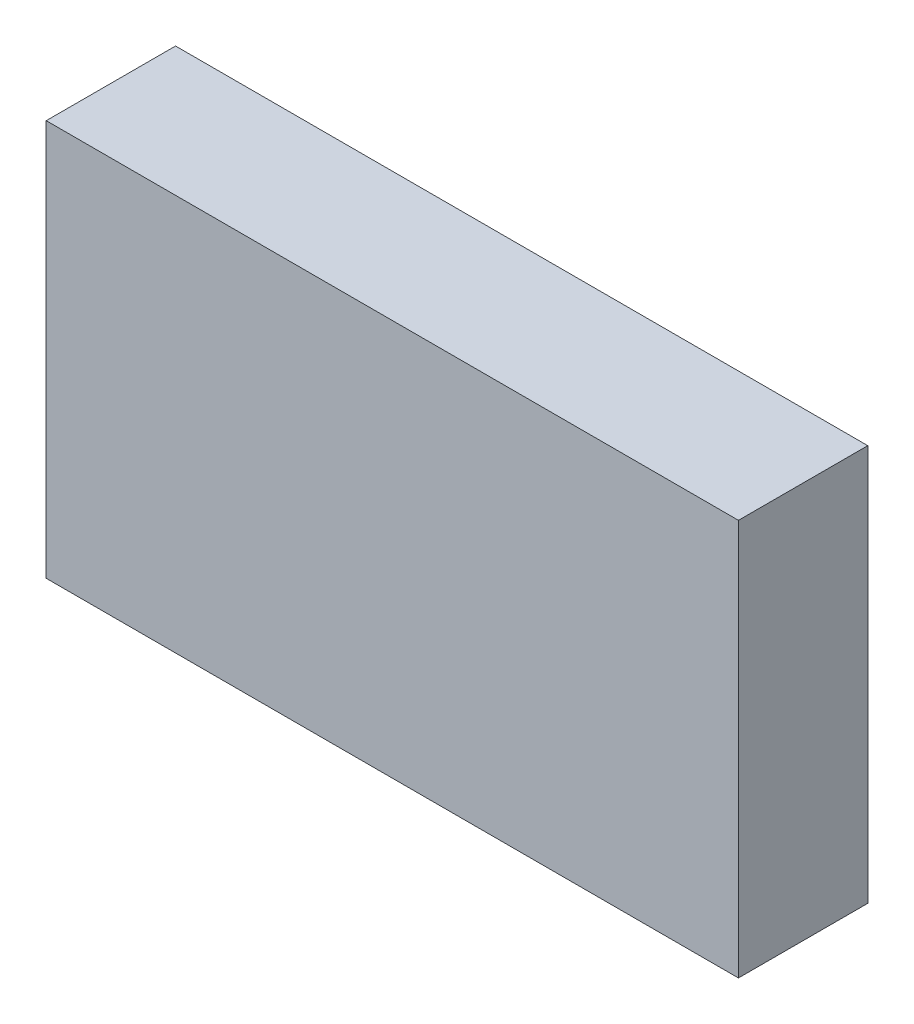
from build123d import *

# Parameters (mm, degrees)
SKETCH1_W           = 622.781
SKETCH1_H           = 1087.628
BOSS_EXTRUDE1_DEPTH = 101.6


with BuildPart() as part:
    # Sketch1 → Boss-Extrude1 (new, symmetric)
    with BuildSketch(Plane(origin=(0, 0, 0), x_dir=(0, 1, 0), z_dir=(0, 0, 1))):
        Rectangle(SKETCH1_W, SKETCH1_H)
    extrude(amount=BOSS_EXTRUDE1_DEPTH, both=True)


solid = part.part
